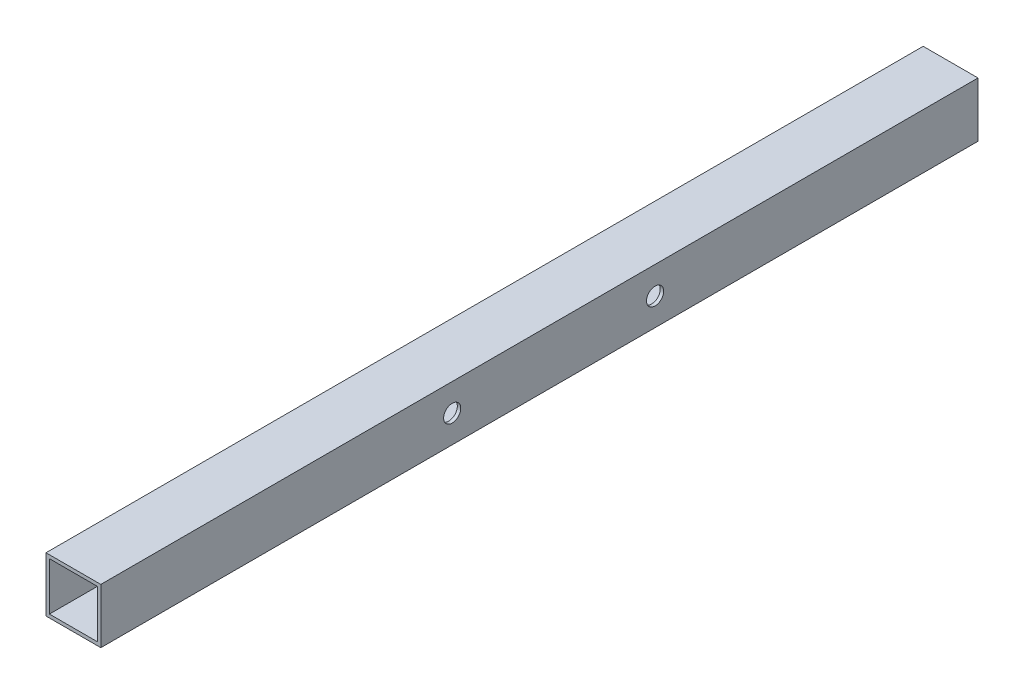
from build123d import *

# Parameters (mm, degrees)
SKETCH1_W           = 50.8
SKETCH1_H           = 50.8
SKETCH1_W_2         = 44.45
SKETCH1_H_2         = 44.45
BOSS_EXTRUDE1_DEPTH = 812.8
SKETCH3_R           = 7.9375
CUT_EXTRUDE1_DEPTH  = 815.781958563


with BuildPart() as part:
    # Sketch1 → Boss-Extrude1 (new body)
    with BuildSketch(Plane.XY):
        Rectangle(SKETCH1_W, SKETCH1_H)
        Rectangle(SKETCH1_W_2, SKETCH1_H_2, mode=Mode.SUBTRACT)
    extrude(amount=-BOSS_EXTRUDE1_DEPTH)

    # Sketch3 → Cut-Extrude1 (cut, through all)
    with BuildSketch(Plane(origin=(25.4, 0, 0), x_dir=(0, 0, -1), z_dir=(1, 0, 0))):
        with Locations(Location((325.5772, 0, 0), (0, 0, 90))):
            Circle(SKETCH3_R)
        with Locations(Location((513.588, 0, 0), (0, 0, 90))):
            Circle(SKETCH3_R)
    extrude(amount=-CUT_EXTRUDE1_DEPTH, mode=Mode.SUBTRACT)


solid = part.part
